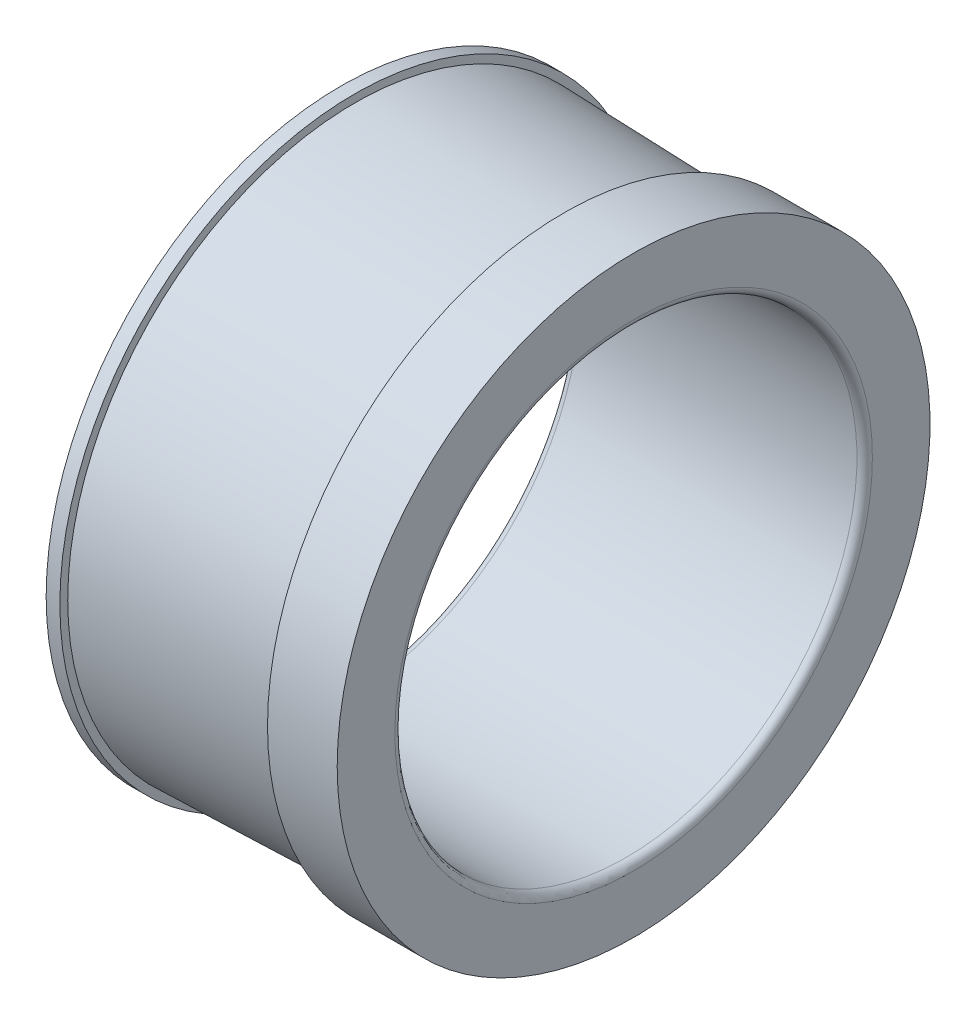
from build123d import *


with BuildPart() as part:
    # Esquisse1 → Base-R_volution (revolve)
    with BuildSketch(Plane(origin=(0, 0, 0), x_dir=(1, 0, 0), z_dir=(0, 1, 0)), mode=Mode.PRIVATE) as base_r_volution_sk:
        with BuildLine():
            Line((37, 30), (1, 30))
            ThreePointArc((1, 30), (0.292893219, 30.292893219), (0, 31))
            Line((0, 31), (0, 38.268047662))
            Line((0, 38.268047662), (1.777884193, 38.268047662))
            Line((1.777884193, 38.268047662), (1.801413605, 37.268047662))
            Line((1.801413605, 37.268047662), (29, 36.483564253))
            Line((29, 36.483564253), (28.952941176, 38.483564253))
            Line((28.952941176, 38.483564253), (38, 38.483564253))
            Line((38, 38.483564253), (38, 31))
            ThreePointArc((38, 31), (37.707106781, 30.292893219), (37, 30))
        make_face()
    revolve(base_r_volution_sk.sketch.rotate(Axis((0, 0, 0), (1, 0, 0)), 180), axis=Axis((0, 0, 0), (1, 0, 0)))


solid = part.part
